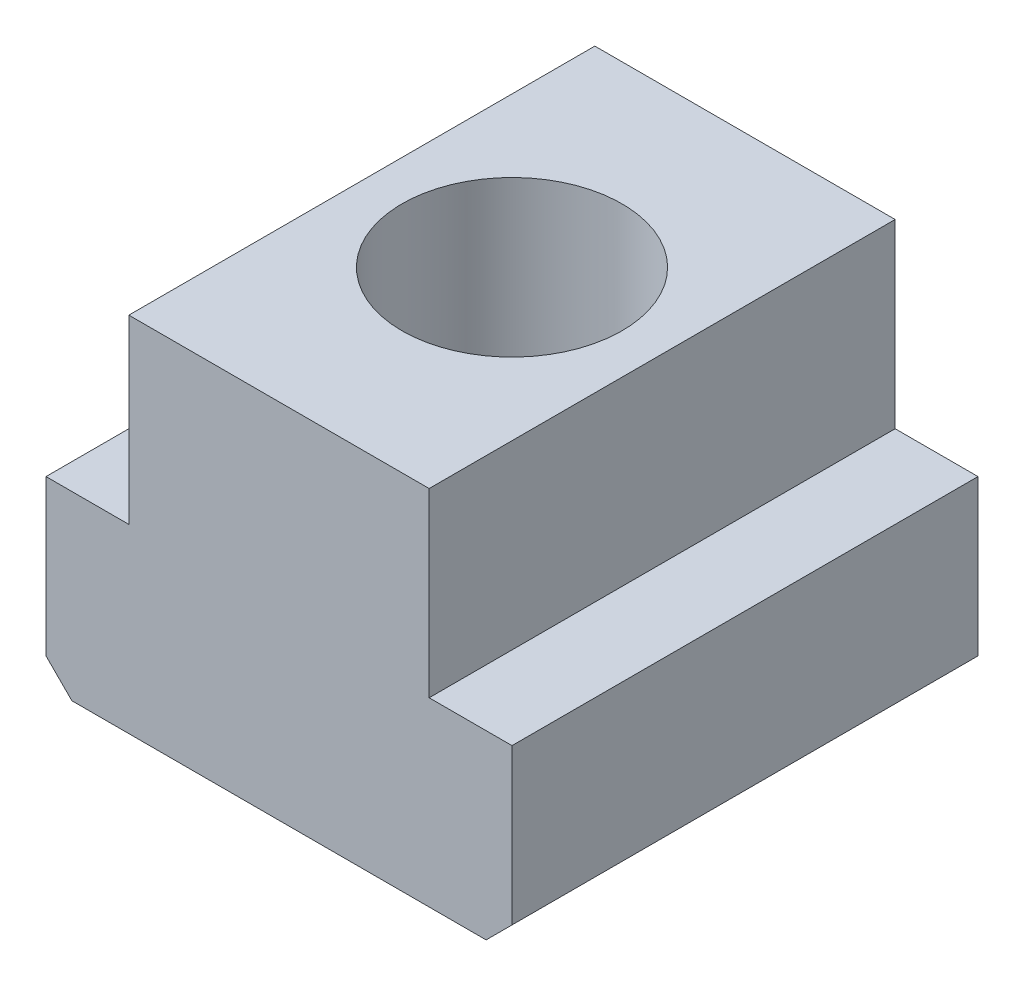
ISO-10303-21;
HEADER;
FILE_DESCRIPTION(('STEP AP214'),'2;1');
FILE_NAME('part.step','',(''),(''),'','','');
FILE_SCHEMA(('AUTOMOTIVE_DESIGN { 1 0 10303 214 1 1 1 1 }'));
ENDSEC;
DATA;
#1=APPLICATION_CONTEXT('core data for automotive mechanical design processes');
#2=APPLICATION_PROTOCOL_DEFINITION('international standard','automotive_design',2000,#1);
#3=PRODUCT_CONTEXT('',#1,'mechanical');
#4=PRODUCT('Part','Part','',(#3));
#5=PRODUCT_RELATED_PRODUCT_CATEGORY('part','',(#4));
#6=PRODUCT_DEFINITION_FORMATION('','',#4);
#7=PRODUCT_DEFINITION_CONTEXT('part definition',#1,'design');
#8=PRODUCT_DEFINITION('design','',#6,#7);
#9=PRODUCT_DEFINITION_SHAPE('','',#8);
#10=(LENGTH_UNIT() NAMED_UNIT(*) SI_UNIT(.MILLI.,.METRE.));
#11=(NAMED_UNIT(*) PLANE_ANGLE_UNIT() SI_UNIT($,.RADIAN.));
#12=(NAMED_UNIT(*) SI_UNIT($,.STERADIAN.) SOLID_ANGLE_UNIT());
#13=UNCERTAINTY_MEASURE_WITH_UNIT(LENGTH_MEASURE(1.E-05),#10,'distance_accuracy_value','');
#14=(GEOMETRIC_REPRESENTATION_CONTEXT(3) GLOBAL_UNCERTAINTY_ASSIGNED_CONTEXT((#13)) GLOBAL_UNIT_ASSIGNED_CONTEXT((#10,
#11,#12)) REPRESENTATION_CONTEXT('',''));
#15=CARTESIAN_POINT('',(0.,0.,0.));
#16=DIRECTION('',(0.,0.,1.));
#17=DIRECTION('',(1.,0.,0.));
#18=AXIS2_PLACEMENT_3D('',#15,#16,#17);
#19=CARTESIAN_POINT('',(-9.,7.,-9.));
#20=DIRECTION('',(0.,1.,0.));
#21=DIRECTION('',(0.,0.,1.));
#22=AXIS2_PLACEMENT_3D('',#19,#20,#21);
#23=PLANE('',#22);
#24=DIRECTION('',(0.,0.,1.));
#25=VECTOR('',#24,1.);
#26=CARTESIAN_POINT('',(-9.,7.,-9.));
#27=LINE('',#26,#25);
#28=CARTESIAN_POINT('',(-9.,7.,-9.));
#29=VERTEX_POINT('',#28);
#30=CARTESIAN_POINT('',(-9.,7.,9.));
#31=VERTEX_POINT('',#30);
#32=EDGE_CURVE('E47',#29,#31,#27,.T.);
#33=ORIENTED_EDGE('',*,*,#32,.T.);
#34=DIRECTION('',(-1.,0.,0.));
#35=VECTOR('',#34,1.);
#36=CARTESIAN_POINT('',(-9.,7.,9.));
#37=LINE('',#36,#35);
#38=CARTESIAN_POINT('',(-5.8,7.,9.));
#39=VERTEX_POINT('',#38);
#40=EDGE_CURVE('E120',#39,#31,#37,.T.);
#41=ORIENTED_EDGE('',*,*,#40,.F.);
#42=DIRECTION('',(0.,0.,1.));
#43=VECTOR('',#42,1.);
#44=CARTESIAN_POINT('',(-5.8,7.,-9.));
#45=LINE('',#44,#43);
#46=CARTESIAN_POINT('',(-5.8,7.,-9.));
#47=VERTEX_POINT('',#46);
#48=EDGE_CURVE('E11',#47,#39,#45,.T.);
#49=ORIENTED_EDGE('',*,*,#48,.F.);
#50=DIRECTION('',(-1.,0.,0.));
#51=VECTOR('',#50,1.);
#52=CARTESIAN_POINT('',(-9.,7.,-9.));
#53=LINE('',#52,#51);
#54=EDGE_CURVE('E121',#47,#29,#53,.T.);
#55=ORIENTED_EDGE('',*,*,#54,.T.);
#56=EDGE_LOOP('',(#33,#41,#49,#55));
#57=FACE_BOUND('',#56,.T.);
#58=ADVANCED_FACE('F44',(#57),#23,.T.);
#59=CARTESIAN_POINT('',(-5.8,7.,-9.));
#60=DIRECTION('',(-1.,0.,0.));
#61=DIRECTION('',(0.,0.,1.));
#62=AXIS2_PLACEMENT_3D('',#59,#60,#61);
#63=PLANE('',#62);
#64=ORIENTED_EDGE('',*,*,#48,.T.);
#65=DIRECTION('',(0.,-1.,0.));
#66=VECTOR('',#65,1.);
#67=CARTESIAN_POINT('',(-5.8,7.,9.));
#68=LINE('',#67,#66);
#69=CARTESIAN_POINT('',(-5.8,14.,9.));
#70=VERTEX_POINT('',#69);
#71=EDGE_CURVE('E138',#70,#39,#68,.T.);
#72=ORIENTED_EDGE('',*,*,#71,.F.);
#73=DIRECTION('',(0.,0.,1.));
#74=VECTOR('',#73,1.);
#75=CARTESIAN_POINT('',(-5.8,14.,-9.));
#76=LINE('',#75,#74);
#77=CARTESIAN_POINT('',(-5.8,14.,-9.));
#78=VERTEX_POINT('',#77);
#79=EDGE_CURVE('E52',#78,#70,#76,.T.);
#80=ORIENTED_EDGE('',*,*,#79,.F.);
#81=DIRECTION('',(0.,-1.,0.));
#82=VECTOR('',#81,1.);
#83=CARTESIAN_POINT('',(-5.8,7.,-9.));
#84=LINE('',#83,#82);
#85=EDGE_CURVE('E126',#78,#47,#84,.T.);
#86=ORIENTED_EDGE('',*,*,#85,.T.);
#87=EDGE_LOOP('',(#64,#72,#80,#86));
#88=FACE_BOUND('',#87,.T.);
#89=ADVANCED_FACE('F231',(#88),#63,.T.);
#90=CARTESIAN_POINT('',(-5.8,14.,-9.));
#91=DIRECTION('',(0.,1.,0.));
#92=DIRECTION('',(0.,0.,1.));
#93=AXIS2_PLACEMENT_3D('',#90,#91,#92);
#94=PLANE('',#93);
#95=CARTESIAN_POINT('',(0.,14.,0.));
#96=DIRECTION('',(0.,1.,0.));
#97=DIRECTION('',(0.,0.,1.));
#98=AXIS2_PLACEMENT_3D('',#95,#96,#97);
#99=CIRCLE('',#98,4.24999999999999);
#100=CARTESIAN_POINT('',(0.,14.,4.24999999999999));
#101=VERTEX_POINT('',#100);
#102=EDGE_CURVE('E142',#101,#101,#99,.T.);
#103=ORIENTED_EDGE('',*,*,#102,.F.);
#104=EDGE_LOOP('',(#103));
#105=FACE_BOUND('',#104,.T.);
#106=ORIENTED_EDGE('',*,*,#79,.T.);
#107=DIRECTION('',(-1.,0.,0.));
#108=VECTOR('',#107,1.);
#109=CARTESIAN_POINT('',(-5.8,14.,9.));
#110=LINE('',#109,#108);
#111=CARTESIAN_POINT('',(5.8,14.,9.));
#112=VERTEX_POINT('',#111);
#113=EDGE_CURVE('E162',#112,#70,#110,.T.);
#114=ORIENTED_EDGE('',*,*,#113,.F.);
#115=DIRECTION('',(0.,0.,1.));
#116=VECTOR('',#115,1.);
#117=CARTESIAN_POINT('',(5.8,14.,-9.));
#118=LINE('',#117,#116);
#119=CARTESIAN_POINT('',(5.8,14.,-9.));
#120=VERTEX_POINT('',#119);
#121=EDGE_CURVE('E190',#120,#112,#118,.T.);
#122=ORIENTED_EDGE('',*,*,#121,.F.);
#123=DIRECTION('',(-1.,0.,0.));
#124=VECTOR('',#123,1.);
#125=CARTESIAN_POINT('',(-5.8,14.,-9.));
#126=LINE('',#125,#124);
#127=EDGE_CURVE('E186',#120,#78,#126,.T.);
#128=ORIENTED_EDGE('',*,*,#127,.T.);
#129=EDGE_LOOP('',(#106,#114,#122,#128));
#130=FACE_BOUND('',#129,.T.);
#131=ADVANCED_FACE('F229',(#105,#130),#94,.T.);
#132=CARTESIAN_POINT('',(5.8,14.,-9.));
#133=DIRECTION('',(1.,0.,0.));
#134=DIRECTION('',(0.,0.,-1.));
#135=AXIS2_PLACEMENT_3D('',#132,#133,#134);
#136=PLANE('',#135);
#137=ORIENTED_EDGE('',*,*,#121,.T.);
#138=DIRECTION('',(0.,1.,0.));
#139=VECTOR('',#138,1.);
#140=CARTESIAN_POINT('',(5.8,14.,9.));
#141=LINE('',#140,#139);
#142=CARTESIAN_POINT('',(5.8,7.,9.));
#143=VERTEX_POINT('',#142);
#144=EDGE_CURVE('E159',#143,#112,#141,.T.);
#145=ORIENTED_EDGE('',*,*,#144,.F.);
#146=DIRECTION('',(0.,0.,1.));
#147=VECTOR('',#146,1.);
#148=CARTESIAN_POINT('',(5.8,7.,-9.));
#149=LINE('',#148,#147);
#150=CARTESIAN_POINT('',(5.8,7.,-9.));
#151=VERTEX_POINT('',#150);
#152=EDGE_CURVE('E192',#151,#143,#149,.T.);
#153=ORIENTED_EDGE('',*,*,#152,.F.);
#154=DIRECTION('',(0.,1.,0.));
#155=VECTOR('',#154,1.);
#156=CARTESIAN_POINT('',(5.8,14.,-9.));
#157=LINE('',#156,#155);
#158=EDGE_CURVE('E183',#151,#120,#157,.T.);
#159=ORIENTED_EDGE('',*,*,#158,.T.);
#160=EDGE_LOOP('',(#137,#145,#153,#159));
#161=FACE_BOUND('',#160,.T.);
#162=ADVANCED_FACE('F225',(#161),#136,.T.);
#163=CARTESIAN_POINT('',(5.8,7.,-9.));
#164=DIRECTION('',(0.,1.,0.));
#165=DIRECTION('',(0.,0.,1.));
#166=AXIS2_PLACEMENT_3D('',#163,#164,#165);
#167=PLANE('',#166);
#168=ORIENTED_EDGE('',*,*,#152,.T.);
#169=DIRECTION('',(-1.,0.,0.));
#170=VECTOR('',#169,1.);
#171=CARTESIAN_POINT('',(5.8,7.,9.));
#172=LINE('',#171,#170);
#173=CARTESIAN_POINT('',(9.,7.,9.));
#174=VERTEX_POINT('',#173);
#175=EDGE_CURVE('E156',#174,#143,#172,.T.);
#176=ORIENTED_EDGE('',*,*,#175,.F.);
#177=DIRECTION('',(0.,0.,1.));
#178=VECTOR('',#177,1.);
#179=CARTESIAN_POINT('',(9.,7.,-9.));
#180=LINE('',#179,#178);
#181=CARTESIAN_POINT('',(9.,7.,-9.));
#182=VERTEX_POINT('',#181);
#183=EDGE_CURVE('E194',#182,#174,#180,.T.);
#184=ORIENTED_EDGE('',*,*,#183,.F.);
#185=DIRECTION('',(-1.,0.,0.));
#186=VECTOR('',#185,1.);
#187=CARTESIAN_POINT('',(5.8,7.,-9.));
#188=LINE('',#187,#186);
#189=EDGE_CURVE('E180',#182,#151,#188,.T.);
#190=ORIENTED_EDGE('',*,*,#189,.T.);
#191=EDGE_LOOP('',(#168,#176,#184,#190));
#192=FACE_BOUND('',#191,.T.);
#193=ADVANCED_FACE('F223',(#192),#167,.T.);
#194=CARTESIAN_POINT('',(9.,7.,-9.));
#195=DIRECTION('',(1.,0.,0.));
#196=DIRECTION('',(0.,0.,-1.));
#197=AXIS2_PLACEMENT_3D('',#194,#195,#196);
#198=PLANE('',#197);
#199=ORIENTED_EDGE('',*,*,#183,.T.);
#200=DIRECTION('',(0.,1.,0.));
#201=VECTOR('',#200,1.);
#202=CARTESIAN_POINT('',(9.,7.,9.));
#203=LINE('',#202,#201);
#204=CARTESIAN_POINT('',(9.,1.,9.));
#205=VERTEX_POINT('',#204);
#206=EDGE_CURVE('E153',#205,#174,#203,.T.);
#207=ORIENTED_EDGE('',*,*,#206,.F.);
#208=DIRECTION('',(0.,0.,1.));
#209=VECTOR('',#208,1.);
#210=CARTESIAN_POINT('',(9.,1.,-9.));
#211=LINE('',#210,#209);
#212=CARTESIAN_POINT('',(9.,1.,-9.));
#213=VERTEX_POINT('',#212);
#214=EDGE_CURVE('E196',#213,#205,#211,.T.);
#215=ORIENTED_EDGE('',*,*,#214,.F.);
#216=DIRECTION('',(0.,1.,0.));
#217=VECTOR('',#216,1.);
#218=CARTESIAN_POINT('',(9.,7.,-9.));
#219=LINE('',#218,#217);
#220=EDGE_CURVE('E177',#213,#182,#219,.T.);
#221=ORIENTED_EDGE('',*,*,#220,.T.);
#222=EDGE_LOOP('',(#199,#207,#215,#221));
#223=FACE_BOUND('',#222,.T.);
#224=ADVANCED_FACE('F218',(#223),#198,.T.);
#225=CARTESIAN_POINT('',(9.,1.,-9.));
#226=DIRECTION('',(0.707106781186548,-0.707106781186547,0.));
#227=DIRECTION('',(0.707106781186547,0.707106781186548,0.));
#228=AXIS2_PLACEMENT_3D('',#225,#226,#227);
#229=PLANE('',#228);
#230=ORIENTED_EDGE('',*,*,#214,.T.);
#231=DIRECTION('',(0.707106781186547,0.707106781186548,0.));
#232=VECTOR('',#231,1.);
#233=CARTESIAN_POINT('',(9.,1.,9.));
#234=LINE('',#233,#232);
#235=CARTESIAN_POINT('',(8.,0.,9.));
#236=VERTEX_POINT('',#235);
#237=EDGE_CURVE('E150',#236,#205,#234,.T.);
#238=ORIENTED_EDGE('',*,*,#237,.F.);
#239=DIRECTION('',(0.,0.,1.));
#240=VECTOR('',#239,1.);
#241=CARTESIAN_POINT('',(8.,0.,-9.));
#242=LINE('',#241,#240);
#243=CARTESIAN_POINT('',(8.,0.,-9.));
#244=VERTEX_POINT('',#243);
#245=EDGE_CURVE('E198',#244,#236,#242,.T.);
#246=ORIENTED_EDGE('',*,*,#245,.F.);
#247=DIRECTION('',(0.707106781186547,0.707106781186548,0.));
#248=VECTOR('',#247,1.);
#249=CARTESIAN_POINT('',(9.,1.,-9.));
#250=LINE('',#249,#248);
#251=EDGE_CURVE('E174',#244,#213,#250,.T.);
#252=ORIENTED_EDGE('',*,*,#251,.T.);
#253=EDGE_LOOP('',(#230,#238,#246,#252));
#254=FACE_BOUND('',#253,.T.);
#255=ADVANCED_FACE('F211',(#254),#229,.T.);
#256=CARTESIAN_POINT('',(8.,0.,-9.));
#257=DIRECTION('',(0.,-1.,0.));
#258=DIRECTION('',(1.,0.,0.));
#259=AXIS2_PLACEMENT_3D('',#256,#257,#258);
#260=PLANE('',#259);
#261=CARTESIAN_POINT('',(0.,0.,0.));
#262=DIRECTION('',(0.,-1.,0.));
#263=DIRECTION('',(1.,0.,0.));
#264=AXIS2_PLACEMENT_3D('',#261,#262,#263);
#265=CIRCLE('',#264,4.24999999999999);
#266=CARTESIAN_POINT('',(4.24999999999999,0.,0.));
#267=VERTEX_POINT('',#266);
#268=EDGE_CURVE('E139',#267,#267,#265,.T.);
#269=ORIENTED_EDGE('',*,*,#268,.F.);
#270=EDGE_LOOP('',(#269));
#271=FACE_BOUND('',#270,.T.);
#272=ORIENTED_EDGE('',*,*,#245,.T.);
#273=DIRECTION('',(1.,0.,0.));
#274=VECTOR('',#273,1.);
#275=CARTESIAN_POINT('',(8.,0.,9.));
#276=LINE('',#275,#274);
#277=CARTESIAN_POINT('',(-8.,0.,9.));
#278=VERTEX_POINT('',#277);
#279=EDGE_CURVE('E147',#278,#236,#276,.T.);
#280=ORIENTED_EDGE('',*,*,#279,.F.);
#281=DIRECTION('',(0.,0.,1.));
#282=VECTOR('',#281,1.);
#283=CARTESIAN_POINT('',(-8.,0.,-9.));
#284=LINE('',#283,#282);
#285=CARTESIAN_POINT('',(-8.,0.,-9.));
#286=VERTEX_POINT('',#285);
#287=EDGE_CURVE('E200',#286,#278,#284,.T.);
#288=ORIENTED_EDGE('',*,*,#287,.F.);
#289=DIRECTION('',(1.,0.,0.));
#290=VECTOR('',#289,1.);
#291=CARTESIAN_POINT('',(8.,0.,-9.));
#292=LINE('',#291,#290);
#293=EDGE_CURVE('E171',#286,#244,#292,.T.);
#294=ORIENTED_EDGE('',*,*,#293,.T.);
#295=EDGE_LOOP('',(#272,#280,#288,#294));
#296=FACE_BOUND('',#295,.T.);
#297=ADVANCED_FACE('F208',(#271,#296),#260,.T.);
#298=CARTESIAN_POINT('',(-8.,0.,-9.));
#299=DIRECTION('',(-0.707106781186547,-0.707106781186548,0.));
#300=DIRECTION('',(0.707106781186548,-0.707106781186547,0.));
#301=AXIS2_PLACEMENT_3D('',#298,#299,#300);
#302=PLANE('',#301);
#303=ORIENTED_EDGE('',*,*,#287,.T.);
#304=DIRECTION('',(0.707106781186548,-0.707106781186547,0.));
#305=VECTOR('',#304,1.);
#306=CARTESIAN_POINT('',(-8.,0.,9.));
#307=LINE('',#306,#305);
#308=CARTESIAN_POINT('',(-9.,0.999999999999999,9.));
#309=VERTEX_POINT('',#308);
#310=EDGE_CURVE('E133',#309,#278,#307,.T.);
#311=ORIENTED_EDGE('',*,*,#310,.F.);
#312=DIRECTION('',(0.,0.,1.));
#313=VECTOR('',#312,1.);
#314=CARTESIAN_POINT('',(-9.,0.999999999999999,-9.));
#315=LINE('',#314,#313);
#316=CARTESIAN_POINT('',(-9.,0.999999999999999,-9.));
#317=VERTEX_POINT('',#316);
#318=EDGE_CURVE('E125',#317,#309,#315,.T.);
#319=ORIENTED_EDGE('',*,*,#318,.F.);
#320=DIRECTION('',(0.707106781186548,-0.707106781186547,0.));
#321=VECTOR('',#320,1.);
#322=CARTESIAN_POINT('',(-8.,0.,-9.));
#323=LINE('',#322,#321);
#324=EDGE_CURVE('E168',#317,#286,#323,.T.);
#325=ORIENTED_EDGE('',*,*,#324,.T.);
#326=EDGE_LOOP('',(#303,#311,#319,#325));
#327=FACE_BOUND('',#326,.T.);
#328=ADVANCED_FACE('F202',(#327),#302,.T.);
#329=CARTESIAN_POINT('',(-9.,0.999999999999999,-9.));
#330=DIRECTION('',(-1.,0.,0.));
#331=DIRECTION('',(0.,0.,1.));
#332=AXIS2_PLACEMENT_3D('',#329,#330,#331);
#333=PLANE('',#332);
#334=ORIENTED_EDGE('',*,*,#318,.T.);
#335=DIRECTION('',(0.,-1.,0.));
#336=VECTOR('',#335,1.);
#337=CARTESIAN_POINT('',(-9.,0.999999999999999,9.));
#338=LINE('',#337,#336);
#339=EDGE_CURVE('E128',#31,#309,#338,.T.);
#340=ORIENTED_EDGE('',*,*,#339,.F.);
#341=ORIENTED_EDGE('',*,*,#32,.F.);
#342=DIRECTION('',(0.,-1.,0.));
#343=VECTOR('',#342,1.);
#344=CARTESIAN_POINT('',(-9.,0.999999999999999,-9.));
#345=LINE('',#344,#343);
#346=EDGE_CURVE('E166',#29,#317,#345,.T.);
#347=ORIENTED_EDGE('',*,*,#346,.T.);
#348=EDGE_LOOP('',(#334,#340,#341,#347));
#349=FACE_BOUND('',#348,.T.);
#350=ADVANCED_FACE('F129',(#349),#333,.T.);
#351=CARTESIAN_POINT('',(0.,0.,-9.));
#352=DIRECTION('',(0.,0.,1.));
#353=DIRECTION('',(1.,0.,0.));
#354=AXIS2_PLACEMENT_3D('',#351,#352,#353);
#355=PLANE('',#354);
#356=ORIENTED_EDGE('',*,*,#54,.F.);
#357=ORIENTED_EDGE('',*,*,#85,.F.);
#358=ORIENTED_EDGE('',*,*,#127,.F.);
#359=ORIENTED_EDGE('',*,*,#158,.F.);
#360=ORIENTED_EDGE('',*,*,#189,.F.);
#361=ORIENTED_EDGE('',*,*,#220,.F.);
#362=ORIENTED_EDGE('',*,*,#251,.F.);
#363=ORIENTED_EDGE('',*,*,#293,.F.);
#364=ORIENTED_EDGE('',*,*,#324,.F.);
#365=ORIENTED_EDGE('',*,*,#346,.F.);
#366=EDGE_LOOP('',(#356,#357,#358,#359,#360,#361,#362,#363,#364,#365));
#367=FACE_BOUND('',#366,.T.);
#368=ADVANCED_FACE('F214',(#367),#355,.F.);
#369=CARTESIAN_POINT('',(0.,0.,9.));
#370=DIRECTION('',(0.,0.,1.));
#371=DIRECTION('',(1.,0.,0.));
#372=AXIS2_PLACEMENT_3D('',#369,#370,#371);
#373=PLANE('',#372);
#374=ORIENTED_EDGE('',*,*,#40,.T.);
#375=ORIENTED_EDGE('',*,*,#339,.T.);
#376=ORIENTED_EDGE('',*,*,#310,.T.);
#377=ORIENTED_EDGE('',*,*,#279,.T.);
#378=ORIENTED_EDGE('',*,*,#237,.T.);
#379=ORIENTED_EDGE('',*,*,#206,.T.);
#380=ORIENTED_EDGE('',*,*,#175,.T.);
#381=ORIENTED_EDGE('',*,*,#144,.T.);
#382=ORIENTED_EDGE('',*,*,#113,.T.);
#383=ORIENTED_EDGE('',*,*,#71,.T.);
#384=EDGE_LOOP('',(#374,#375,#376,#377,#378,#379,#380,#381,#382,#383));
#385=FACE_BOUND('',#384,.T.);
#386=ADVANCED_FACE('F136',(#385),#373,.T.);
#387=CARTESIAN_POINT('',(0.,14.,0.));
#388=DIRECTION('',(0.,1.,0.));
#389=DIRECTION('',(0.,0.,1.));
#390=AXIS2_PLACEMENT_3D('',#387,#388,#389);
#391=CYLINDRICAL_SURFACE('',#390,4.24999999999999);
#392=ORIENTED_EDGE('',*,*,#102,.T.);
#393=EDGE_LOOP('',(#392));
#394=FACE_BOUND('',#393,.T.);
#395=ORIENTED_EDGE('',*,*,#268,.T.);
#396=EDGE_LOOP('',(#395));
#397=FACE_BOUND('',#396,.T.);
#398=ADVANCED_FACE('F262',(#394,#397),#391,.F.);
#399=CLOSED_SHELL('',(#58,#89,#131,#162,#193,#224,#255,#297,#328,#350,#368,#386,#398));
#400=MANIFOLD_SOLID_BREP('B2',#399);
#401=ADVANCED_BREP_SHAPE_REPRESENTATION('',(#18,#400),#14);
#402=SHAPE_DEFINITION_REPRESENTATION(#9,#401);
ENDSEC;
END-ISO-10303-21;
